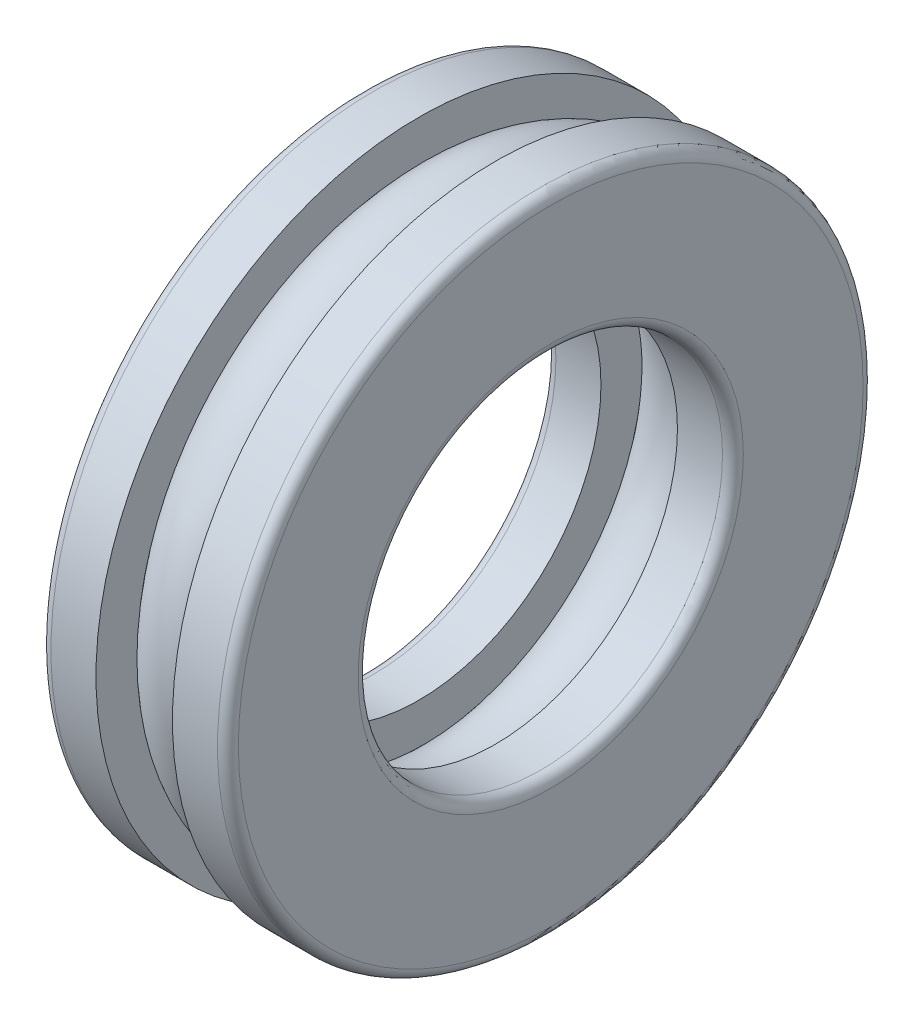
ISO-10303-21;
HEADER;
FILE_DESCRIPTION(('STEP AP214'),'2;1');
FILE_NAME('part.step','',(''),(''),'','','');
FILE_SCHEMA(('AUTOMOTIVE_DESIGN { 1 0 10303 214 1 1 1 1 }'));
ENDSEC;
DATA;
#1=APPLICATION_CONTEXT('core data for automotive mechanical design processes');
#2=APPLICATION_PROTOCOL_DEFINITION('international standard','automotive_design',2000,#1);
#3=PRODUCT_CONTEXT('',#1,'mechanical');
#4=PRODUCT('Part','Part','',(#3));
#5=PRODUCT_RELATED_PRODUCT_CATEGORY('part','',(#4));
#6=PRODUCT_DEFINITION_FORMATION('','',#4);
#7=PRODUCT_DEFINITION_CONTEXT('part definition',#1,'design');
#8=PRODUCT_DEFINITION('design','',#6,#7);
#9=PRODUCT_DEFINITION_SHAPE('','',#8);
#10=(LENGTH_UNIT() NAMED_UNIT(*) SI_UNIT(.MILLI.,.METRE.));
#11=(NAMED_UNIT(*) PLANE_ANGLE_UNIT() SI_UNIT($,.RADIAN.));
#12=(NAMED_UNIT(*) SI_UNIT($,.STERADIAN.) SOLID_ANGLE_UNIT());
#13=UNCERTAINTY_MEASURE_WITH_UNIT(LENGTH_MEASURE(1.E-05),#10,'distance_accuracy_value','');
#14=(GEOMETRIC_REPRESENTATION_CONTEXT(3) GLOBAL_UNCERTAINTY_ASSIGNED_CONTEXT((#13)) GLOBAL_UNIT_ASSIGNED_CONTEXT((#10,
#11,#12)) REPRESENTATION_CONTEXT('',''));
#15=CARTESIAN_POINT('',(0.,0.,0.));
#16=DIRECTION('',(0.,0.,1.));
#17=DIRECTION('',(1.,0.,0.));
#18=AXIS2_PLACEMENT_3D('',#15,#16,#17);
#19=CARTESIAN_POINT('',(0.,0.,0.));
#20=DIRECTION('',(-1.,0.,0.));
#21=DIRECTION('',(0.,0.,1.));
#22=AXIS2_PLACEMENT_3D('',#19,#20,#21);
#23=TOROIDAL_SURFACE('',#22,24.25,4.59);
#24=CARTESIAN_POINT('',(3.672,0.,0.));
#25=DIRECTION('',(-1.,0.,0.));
#26=DIRECTION('',(0.,0.,1.));
#27=AXIS2_PLACEMENT_3D('',#24,#25,#26);
#28=CIRCLE('',#27,27.004);
#29=CARTESIAN_POINT('',(3.672,0.,27.004));
#30=VERTEX_POINT('',#29);
#31=EDGE_CURVE('E36',#30,#30,#28,.T.);
#32=ORIENTED_EDGE('',*,*,#31,.T.);
#33=EDGE_LOOP('',(#32));
#34=FACE_BOUND('',#33,.T.);
#35=CARTESIAN_POINT('',(-3.672,0.,0.));
#36=DIRECTION('',(1.,0.,0.));
#37=DIRECTION('',(0.,0.,-1.));
#38=AXIS2_PLACEMENT_3D('',#35,#36,#37);
#39=CIRCLE('',#38,27.004);
#40=CARTESIAN_POINT('',(-3.672,0.,-27.004));
#41=VERTEX_POINT('',#40);
#42=EDGE_CURVE('E51',#41,#41,#39,.F.);
#43=ORIENTED_EDGE('',*,*,#42,.F.);
#44=EDGE_LOOP('',(#43));
#45=FACE_BOUND('',#44,.T.);
#46=ADVANCED_FACE('F32',(#34,#45),#23,.T.);
#47=CARTESIAN_POINT('',(-3.672,21.5378715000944,0.));
#48=DIRECTION('',(1.,0.,0.));
#49=DIRECTION('',(0.,0.,-1.));
#50=AXIS2_PLACEMENT_3D('',#47,#48,#49);
#51=PLANE('',#50);
#52=CARTESIAN_POINT('',(-3.67199999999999,0.,0.));
#53=DIRECTION('',(1.,0.,0.));
#54=DIRECTION('',(0.,0.,-1.));
#55=AXIS2_PLACEMENT_3D('',#52,#53,#54);
#56=CIRCLE('',#55,17.5);
#57=CARTESIAN_POINT('',(-3.67199999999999,0.,-17.5));
#58=VERTEX_POINT('',#57);
#59=EDGE_CURVE('E70',#58,#58,#56,.T.);
#60=ORIENTED_EDGE('',*,*,#59,.F.);
#61=EDGE_LOOP('',(#60));
#62=FACE_BOUND('',#61,.T.);
#63=CARTESIAN_POINT('',(-3.672,0.,0.));
#64=DIRECTION('',(-1.,0.,0.));
#65=DIRECTION('',(0.,0.,1.));
#66=AXIS2_PLACEMENT_3D('',#63,#64,#65);
#67=CIRCLE('',#66,21.496);
#68=CARTESIAN_POINT('',(-3.672,0.,21.496));
#69=VERTEX_POINT('',#68);
#70=EDGE_CURVE('E49',#69,#69,#67,.F.);
#71=ORIENTED_EDGE('',*,*,#70,.T.);
#72=EDGE_LOOP('',(#71));
#73=FACE_BOUND('',#72,.T.);
#74=ADVANCED_FACE('F99',(#62,#73),#51,.T.);
#75=CARTESIAN_POINT('',(-3.672,31.,0.));
#76=DIRECTION('',(1.,0.,0.));
#77=DIRECTION('',(0.,0.,-1.));
#78=AXIS2_PLACEMENT_3D('',#75,#76,#77);
#79=PLANE('',#78);
#80=ORIENTED_EDGE('',*,*,#42,.T.);
#81=EDGE_LOOP('',(#80));
#82=FACE_BOUND('',#81,.T.);
#83=CARTESIAN_POINT('',(-3.672,0.,0.));
#84=DIRECTION('',(1.,0.,0.));
#85=DIRECTION('',(0.,0.,-1.));
#86=AXIS2_PLACEMENT_3D('',#83,#84,#85);
#87=CIRCLE('',#86,31.);
#88=CARTESIAN_POINT('',(-3.672,0.,-31.));
#89=VERTEX_POINT('',#88);
#90=EDGE_CURVE('E10',#89,#89,#87,.T.);
#91=ORIENTED_EDGE('',*,*,#90,.T.);
#92=EDGE_LOOP('',(#91));
#93=FACE_BOUND('',#92,.T.);
#94=ADVANCED_FACE('F34',(#82,#93),#79,.T.);
#95=CARTESIAN_POINT('',(-34.925,0.,0.));
#96=DIRECTION('',(1.,0.,0.));
#97=DIRECTION('',(0.,0.,-1.));
#98=AXIS2_PLACEMENT_3D('',#95,#96,#97);
#99=CYLINDRICAL_SURFACE('',#98,31.);
#100=CARTESIAN_POINT('',(-8.,0.,0.));
#101=DIRECTION('',(1.,0.,0.));
#102=DIRECTION('',(0.,0.,-1.));
#103=AXIS2_PLACEMENT_3D('',#100,#101,#102);
#104=CIRCLE('',#103,31.);
#105=CARTESIAN_POINT('',(-8.,0.,-31.));
#106=VERTEX_POINT('',#105);
#107=EDGE_CURVE('E40',#106,#106,#104,.T.);
#108=ORIENTED_EDGE('',*,*,#107,.T.);
#109=EDGE_LOOP('',(#108));
#110=FACE_BOUND('',#109,.T.);
#111=ORIENTED_EDGE('',*,*,#90,.F.);
#112=EDGE_LOOP('',(#111));
#113=FACE_BOUND('',#112,.T.);
#114=ADVANCED_FACE('F96',(#110,#113),#99,.T.);
#115=CARTESIAN_POINT('',(-8.,0.,0.));
#116=DIRECTION('',(1.,0.,0.));
#117=DIRECTION('',(0.,0.,-1.));
#118=AXIS2_PLACEMENT_3D('',#115,#116,#117);
#119=TOROIDAL_SURFACE('',#118,30.,1.);
#120=CARTESIAN_POINT('',(-9.,0.,0.));
#121=DIRECTION('',(1.,0.,0.));
#122=DIRECTION('',(0.,0.,-1.));
#123=AXIS2_PLACEMENT_3D('',#120,#121,#122);
#124=CIRCLE('',#123,30.);
#125=CARTESIAN_POINT('',(-9.,0.,-30.));
#126=VERTEX_POINT('',#125);
#127=EDGE_CURVE('E45',#126,#126,#124,.T.);
#128=ORIENTED_EDGE('',*,*,#127,.T.);
#129=EDGE_LOOP('',(#128));
#130=FACE_BOUND('',#129,.T.);
#131=ORIENTED_EDGE('',*,*,#107,.F.);
#132=EDGE_LOOP('',(#131));
#133=FACE_BOUND('',#132,.T.);
#134=ADVANCED_FACE('F81',(#130,#133),#119,.T.);
#135=CARTESIAN_POINT('',(-9.,18.5,0.));
#136=DIRECTION('',(-1.,0.,0.));
#137=DIRECTION('',(0.,0.,1.));
#138=AXIS2_PLACEMENT_3D('',#135,#136,#137);
#139=PLANE('',#138);
#140=CARTESIAN_POINT('',(-9.,0.,0.));
#141=DIRECTION('',(1.,0.,0.));
#142=DIRECTION('',(0.,0.,-1.));
#143=AXIS2_PLACEMENT_3D('',#140,#141,#142);
#144=CIRCLE('',#143,18.5);
#145=CARTESIAN_POINT('',(-9.,0.,-18.5));
#146=VERTEX_POINT('',#145);
#147=EDGE_CURVE('E76',#146,#146,#144,.T.);
#148=ORIENTED_EDGE('',*,*,#147,.T.);
#149=EDGE_LOOP('',(#148));
#150=FACE_BOUND('',#149,.T.);
#151=ORIENTED_EDGE('',*,*,#127,.F.);
#152=EDGE_LOOP('',(#151));
#153=FACE_BOUND('',#152,.T.);
#154=ADVANCED_FACE('F84',(#150,#153),#139,.T.);
#155=CARTESIAN_POINT('',(-8.,0.,0.));
#156=DIRECTION('',(1.,0.,0.));
#157=DIRECTION('',(0.,0.,-1.));
#158=AXIS2_PLACEMENT_3D('',#155,#156,#157);
#159=TOROIDAL_SURFACE('',#158,18.5,1.);
#160=CARTESIAN_POINT('',(-8.,0.,0.));
#161=DIRECTION('',(1.,0.,0.));
#162=DIRECTION('',(0.,0.,-1.));
#163=AXIS2_PLACEMENT_3D('',#160,#161,#162);
#164=CIRCLE('',#163,17.5);
#165=CARTESIAN_POINT('',(-8.,0.,-17.5));
#166=VERTEX_POINT('',#165);
#167=EDGE_CURVE('E73',#166,#166,#164,.T.);
#168=ORIENTED_EDGE('',*,*,#167,.T.);
#169=EDGE_LOOP('',(#168));
#170=FACE_BOUND('',#169,.T.);
#171=ORIENTED_EDGE('',*,*,#147,.F.);
#172=EDGE_LOOP('',(#171));
#173=FACE_BOUND('',#172,.T.);
#174=ADVANCED_FACE('F86',(#170,#173),#159,.T.);
#175=CARTESIAN_POINT('',(-34.925,0.,0.));
#176=DIRECTION('',(1.,0.,0.));
#177=DIRECTION('',(0.,0.,-1.));
#178=AXIS2_PLACEMENT_3D('',#175,#176,#177);
#179=CYLINDRICAL_SURFACE('',#178,17.5);
#180=ORIENTED_EDGE('',*,*,#59,.T.);
#181=EDGE_LOOP('',(#180));
#182=FACE_BOUND('',#181,.T.);
#183=ORIENTED_EDGE('',*,*,#167,.F.);
#184=EDGE_LOOP('',(#183));
#185=FACE_BOUND('',#184,.T.);
#186=ADVANCED_FACE('F93',(#182,#185),#179,.F.);
#187=CARTESIAN_POINT('',(3.672,0.,0.));
#188=DIRECTION('',(1.,0.,0.));
#189=DIRECTION('',(0.,0.,-1.));
#190=AXIS2_PLACEMENT_3D('',#187,#188,#189);
#191=CIRCLE('',#190,21.496);
#192=CARTESIAN_POINT('',(3.672,0.,-21.496));
#193=VERTEX_POINT('',#192);
#194=EDGE_CURVE('E52',#193,#193,#191,.T.);
#195=ORIENTED_EDGE('',*,*,#194,.T.);
#196=EDGE_LOOP('',(#195));
#197=FACE_BOUND('',#196,.T.);
#198=ORIENTED_EDGE('',*,*,#70,.F.);
#199=EDGE_LOOP('',(#198));
#200=FACE_BOUND('',#199,.T.);
#201=ADVANCED_FACE('F102',(#197,#200),#23,.T.);
#202=CARTESIAN_POINT('',(3.672,21.5378715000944,0.));
#203=DIRECTION('',(-1.,0.,0.));
#204=DIRECTION('',(0.,0.,-1.));
#205=AXIS2_PLACEMENT_3D('',#202,#203,#204);
#206=PLANE('',#205);
#207=CARTESIAN_POINT('',(3.67199999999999,0.,0.));
#208=DIRECTION('',(1.,0.,0.));
#209=DIRECTION('',(0.,0.,-1.));
#210=AXIS2_PLACEMENT_3D('',#207,#208,#209);
#211=CIRCLE('',#210,17.5);
#212=CARTESIAN_POINT('',(3.67199999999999,0.,-17.5));
#213=VERTEX_POINT('',#212);
#214=EDGE_CURVE('E246',#213,#213,#211,.T.);
#215=ORIENTED_EDGE('',*,*,#214,.T.);
#216=EDGE_LOOP('',(#215));
#217=FACE_BOUND('',#216,.T.);
#218=ORIENTED_EDGE('',*,*,#194,.F.);
#219=EDGE_LOOP('',(#218));
#220=FACE_BOUND('',#219,.T.);
#221=ADVANCED_FACE('F111',(#217,#220),#206,.T.);
#222=CARTESIAN_POINT('',(3.672,31.,0.));
#223=DIRECTION('',(-1.,0.,0.));
#224=DIRECTION('',(0.,0.,-1.));
#225=AXIS2_PLACEMENT_3D('',#222,#223,#224);
#226=PLANE('',#225);
#227=ORIENTED_EDGE('',*,*,#31,.F.);
#228=EDGE_LOOP('',(#227));
#229=FACE_BOUND('',#228,.T.);
#230=CARTESIAN_POINT('',(3.672,0.,0.));
#231=DIRECTION('',(1.,0.,0.));
#232=DIRECTION('',(0.,0.,-1.));
#233=AXIS2_PLACEMENT_3D('',#230,#231,#232);
#234=CIRCLE('',#233,31.);
#235=CARTESIAN_POINT('',(3.672,0.,-31.));
#236=VERTEX_POINT('',#235);
#237=EDGE_CURVE('E54',#236,#236,#234,.T.);
#238=ORIENTED_EDGE('',*,*,#237,.F.);
#239=EDGE_LOOP('',(#238));
#240=FACE_BOUND('',#239,.T.);
#241=ADVANCED_FACE('F116',(#229,#240),#226,.T.);
#242=CARTESIAN_POINT('',(34.925,0.,0.));
#243=DIRECTION('',(-1.,0.,0.));
#244=DIRECTION('',(0.,0.,-1.));
#245=AXIS2_PLACEMENT_3D('',#242,#243,#244);
#246=CYLINDRICAL_SURFACE('',#245,31.);
#247=CARTESIAN_POINT('',(8.,0.,0.));
#248=DIRECTION('',(1.,0.,0.));
#249=DIRECTION('',(0.,0.,-1.));
#250=AXIS2_PLACEMENT_3D('',#247,#248,#249);
#251=CIRCLE('',#250,31.);
#252=CARTESIAN_POINT('',(8.,0.,-31.));
#253=VERTEX_POINT('',#252);
#254=EDGE_CURVE('E59',#253,#253,#251,.T.);
#255=ORIENTED_EDGE('',*,*,#254,.F.);
#256=EDGE_LOOP('',(#255));
#257=FACE_BOUND('',#256,.T.);
#258=ORIENTED_EDGE('',*,*,#237,.T.);
#259=EDGE_LOOP('',(#258));
#260=FACE_BOUND('',#259,.T.);
#261=ADVANCED_FACE('F190',(#257,#260),#246,.T.);
#262=CARTESIAN_POINT('',(8.,0.,0.));
#263=DIRECTION('',(-1.,0.,0.));
#264=DIRECTION('',(0.,0.,-1.));
#265=AXIS2_PLACEMENT_3D('',#262,#263,#264);
#266=TOROIDAL_SURFACE('',#265,30.,1.);
#267=CARTESIAN_POINT('',(9.,0.,0.));
#268=DIRECTION('',(1.,0.,0.));
#269=DIRECTION('',(0.,0.,-1.));
#270=AXIS2_PLACEMENT_3D('',#267,#268,#269);
#271=CIRCLE('',#270,30.);
#272=CARTESIAN_POINT('',(9.,0.,-30.));
#273=VERTEX_POINT('',#272);
#274=EDGE_CURVE('E64',#273,#273,#271,.T.);
#275=ORIENTED_EDGE('',*,*,#274,.F.);
#276=EDGE_LOOP('',(#275));
#277=FACE_BOUND('',#276,.T.);
#278=ORIENTED_EDGE('',*,*,#254,.T.);
#279=EDGE_LOOP('',(#278));
#280=FACE_BOUND('',#279,.T.);
#281=ADVANCED_FACE('F198',(#277,#280),#266,.T.);
#282=CARTESIAN_POINT('',(9.,18.5,0.));
#283=DIRECTION('',(1.,0.,0.));
#284=DIRECTION('',(0.,0.,1.));
#285=AXIS2_PLACEMENT_3D('',#282,#283,#284);
#286=PLANE('',#285);
#287=CARTESIAN_POINT('',(9.,0.,0.));
#288=DIRECTION('',(1.,0.,0.));
#289=DIRECTION('',(0.,0.,-1.));
#290=AXIS2_PLACEMENT_3D('',#287,#288,#289);
#291=CIRCLE('',#290,18.5);
#292=CARTESIAN_POINT('',(9.,0.,-18.5));
#293=VERTEX_POINT('',#292);
#294=EDGE_CURVE('E250',#293,#293,#291,.T.);
#295=ORIENTED_EDGE('',*,*,#294,.F.);
#296=EDGE_LOOP('',(#295));
#297=FACE_BOUND('',#296,.T.);
#298=ORIENTED_EDGE('',*,*,#274,.T.);
#299=EDGE_LOOP('',(#298));
#300=FACE_BOUND('',#299,.T.);
#301=ADVANCED_FACE('F207',(#297,#300),#286,.T.);
#302=CARTESIAN_POINT('',(8.,0.,0.));
#303=DIRECTION('',(-1.,0.,0.));
#304=DIRECTION('',(0.,0.,-1.));
#305=AXIS2_PLACEMENT_3D('',#302,#303,#304);
#306=TOROIDAL_SURFACE('',#305,18.5,1.);
#307=CARTESIAN_POINT('',(8.,0.,0.));
#308=DIRECTION('',(1.,0.,0.));
#309=DIRECTION('',(0.,0.,-1.));
#310=AXIS2_PLACEMENT_3D('',#307,#308,#309);
#311=CIRCLE('',#310,17.5);
#312=CARTESIAN_POINT('',(8.,0.,-17.5));
#313=VERTEX_POINT('',#312);
#314=EDGE_CURVE('E249',#313,#313,#311,.T.);
#315=ORIENTED_EDGE('',*,*,#314,.F.);
#316=EDGE_LOOP('',(#315));
#317=FACE_BOUND('',#316,.T.);
#318=ORIENTED_EDGE('',*,*,#294,.T.);
#319=EDGE_LOOP('',(#318));
#320=FACE_BOUND('',#319,.T.);
#321=ADVANCED_FACE('F216',(#317,#320),#306,.T.);
#322=CARTESIAN_POINT('',(34.925,0.,0.));
#323=DIRECTION('',(-1.,0.,0.));
#324=DIRECTION('',(0.,0.,-1.));
#325=AXIS2_PLACEMENT_3D('',#322,#323,#324);
#326=CYLINDRICAL_SURFACE('',#325,17.5);
#327=ORIENTED_EDGE('',*,*,#214,.F.);
#328=EDGE_LOOP('',(#327));
#329=FACE_BOUND('',#328,.T.);
#330=ORIENTED_EDGE('',*,*,#314,.T.);
#331=EDGE_LOOP('',(#330));
#332=FACE_BOUND('',#331,.T.);
#333=ADVANCED_FACE('F225',(#329,#332),#326,.F.);
#334=CLOSED_SHELL('',(#46,#74,#94,#114,#134,#154,#174,#186,#201,#221,#241,#261,#281,#301,#321,#333));
#335=MANIFOLD_SOLID_BREP('B2',#334);
#336=ADVANCED_BREP_SHAPE_REPRESENTATION('',(#18,#335),#14);
#337=SHAPE_DEFINITION_REPRESENTATION(#9,#336);
ENDSEC;
END-ISO-10303-21;
